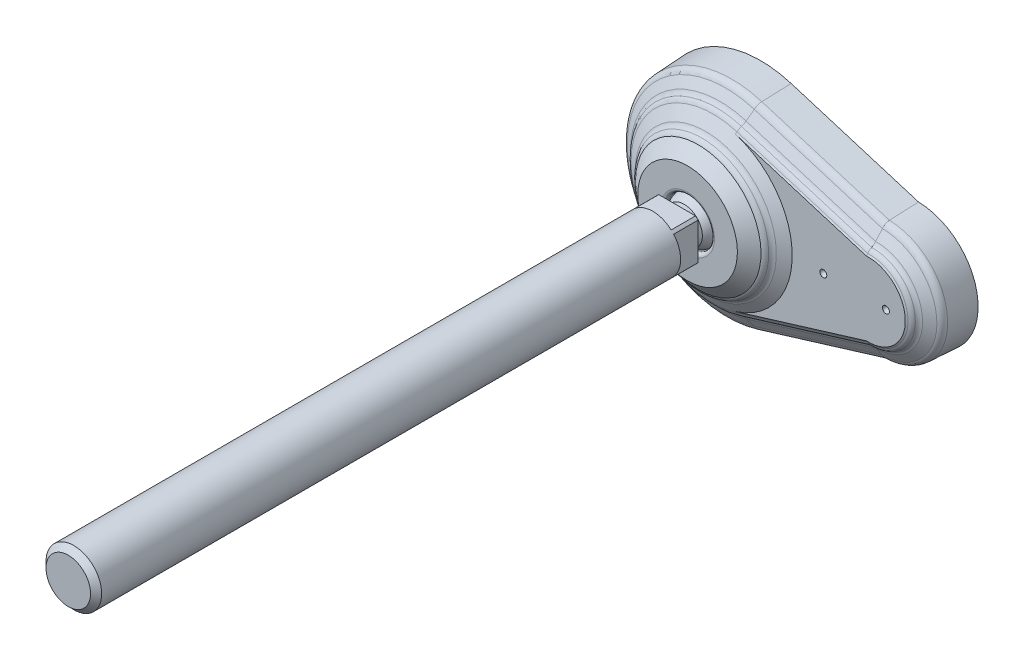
ISO-10303-21;
HEADER;
FILE_DESCRIPTION(('STEP AP214'),'2;1');
FILE_NAME('part.step','',(''),(''),'','','');
FILE_SCHEMA(('AUTOMOTIVE_DESIGN { 1 0 10303 214 1 1 1 1 }'));
ENDSEC;
DATA;
#1=APPLICATION_CONTEXT('core data for automotive mechanical design processes');
#2=APPLICATION_PROTOCOL_DEFINITION('international standard','automotive_design',2000,#1);
#3=PRODUCT_CONTEXT('',#1,'mechanical');
#4=PRODUCT('Part','Part','',(#3));
#5=PRODUCT_RELATED_PRODUCT_CATEGORY('part','',(#4));
#6=PRODUCT_DEFINITION_FORMATION('','',#4);
#7=PRODUCT_DEFINITION_CONTEXT('part definition',#1,'design');
#8=PRODUCT_DEFINITION('design','',#6,#7);
#9=PRODUCT_DEFINITION_SHAPE('','',#8);
#10=(LENGTH_UNIT() NAMED_UNIT(*) SI_UNIT(.MILLI.,.METRE.));
#11=(NAMED_UNIT(*) PLANE_ANGLE_UNIT() SI_UNIT($,.RADIAN.));
#12=(NAMED_UNIT(*) SI_UNIT($,.STERADIAN.) SOLID_ANGLE_UNIT());
#13=UNCERTAINTY_MEASURE_WITH_UNIT(LENGTH_MEASURE(1.E-05),#10,'distance_accuracy_value','');
#14=(GEOMETRIC_REPRESENTATION_CONTEXT(3) GLOBAL_UNCERTAINTY_ASSIGNED_CONTEXT((#13)) GLOBAL_UNIT_ASSIGNED_CONTEXT((#10,
#11,#12)) REPRESENTATION_CONTEXT('',''));
#15=CARTESIAN_POINT('',(0.,0.,0.));
#16=DIRECTION('',(0.,0.,1.));
#17=DIRECTION('',(1.,0.,0.));
#18=AXIS2_PLACEMENT_3D('',#15,#16,#17);
#19=CARTESIAN_POINT('',(0.,0.,31.));
#20=DIRECTION('',(0.,0.,1.));
#21=DIRECTION('',(-1.,0.,0.));
#22=AXIS2_PLACEMENT_3D('',#19,#20,#21);
#23=CYLINDRICAL_SURFACE('',#22,8.);
#24=CARTESIAN_POINT('',(0.,0.,197.4));
#25=DIRECTION('',(0.,0.,1.));
#26=DIRECTION('',(1.,0.,0.));
#27=AXIS2_PLACEMENT_3D('',#24,#25,#26);
#28=CIRCLE('',#27,8.);
#29=CARTESIAN_POINT('',(8.,0.,197.4));
#30=VERTEX_POINT('',#29);
#31=EDGE_CURVE('E9',#30,#30,#28,.F.);
#32=ORIENTED_EDGE('',*,*,#31,.T.);
#33=EDGE_LOOP('',(#32));
#34=FACE_BOUND('',#33,.T.);
#35=DIRECTION('',(0.,0.,1.));
#36=VECTOR('',#35,1.);
#37=CARTESIAN_POINT('',(6.,-5.29150262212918,31.));
#38=LINE('',#37,#36);
#39=CARTESIAN_POINT('',(6.,-5.29150262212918,31.));
#40=VERTEX_POINT('',#39);
#41=CARTESIAN_POINT('',(6.,-5.29150262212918,24.));
#42=VERTEX_POINT('',#41);
#43=EDGE_CURVE('E197',#40,#42,#38,.F.);
#44=ORIENTED_EDGE('',*,*,#43,.F.);
#45=CARTESIAN_POINT('',(0.,0.,31.));
#46=DIRECTION('',(0.,0.,1.));
#47=DIRECTION('',(1.,0.,0.));
#48=AXIS2_PLACEMENT_3D('',#45,#46,#47);
#49=CIRCLE('',#48,8.);
#50=CARTESIAN_POINT('',(6.,5.29150262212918,31.));
#51=VERTEX_POINT('',#50);
#52=EDGE_CURVE('E588',#40,#51,#49,.T.);
#53=ORIENTED_EDGE('',*,*,#52,.T.);
#54=DIRECTION('',(0.,0.,1.));
#55=VECTOR('',#54,1.);
#56=CARTESIAN_POINT('',(6.,5.29150262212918,31.));
#57=LINE('',#56,#55);
#58=CARTESIAN_POINT('',(6.,5.29150262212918,24.));
#59=VERTEX_POINT('',#58);
#60=EDGE_CURVE('E207',#59,#51,#57,.T.);
#61=ORIENTED_EDGE('',*,*,#60,.F.);
#62=CARTESIAN_POINT('',(0.,0.,24.));
#63=DIRECTION('',(0.,0.,1.));
#64=DIRECTION('',(-1.,0.,0.));
#65=AXIS2_PLACEMENT_3D('',#62,#63,#64);
#66=CIRCLE('',#65,8.);
#67=CARTESIAN_POINT('',(5.29150262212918,6.,24.));
#68=VERTEX_POINT('',#67);
#69=EDGE_CURVE('E180',#59,#68,#66,.T.);
#70=ORIENTED_EDGE('',*,*,#69,.T.);
#71=DIRECTION('',(0.,0.,1.));
#72=VECTOR('',#71,1.);
#73=CARTESIAN_POINT('',(5.29150262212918,6.,31.));
#74=LINE('',#73,#72);
#75=CARTESIAN_POINT('',(5.29150262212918,6.,31.));
#76=VERTEX_POINT('',#75);
#77=EDGE_CURVE('E161',#76,#68,#74,.F.);
#78=ORIENTED_EDGE('',*,*,#77,.F.);
#79=CARTESIAN_POINT('',(-5.29150262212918,6.,31.));
#80=VERTEX_POINT('',#79);
#81=EDGE_CURVE('E174',#76,#80,#49,.T.);
#82=ORIENTED_EDGE('',*,*,#81,.T.);
#83=DIRECTION('',(0.,0.,1.));
#84=VECTOR('',#83,1.);
#85=CARTESIAN_POINT('',(-5.29150262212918,6.,31.));
#86=LINE('',#85,#84);
#87=CARTESIAN_POINT('',(-5.29150262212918,6.,24.));
#88=VERTEX_POINT('',#87);
#89=EDGE_CURVE('E159',#88,#80,#86,.T.);
#90=ORIENTED_EDGE('',*,*,#89,.F.);
#91=CARTESIAN_POINT('',(-6.,5.29150262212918,24.));
#92=VERTEX_POINT('',#91);
#93=EDGE_CURVE('E172',#88,#92,#66,.T.);
#94=ORIENTED_EDGE('',*,*,#93,.T.);
#95=DIRECTION('',(0.,0.,1.));
#96=VECTOR('',#95,1.);
#97=CARTESIAN_POINT('',(-6.,5.29150262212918,31.));
#98=LINE('',#97,#96);
#99=CARTESIAN_POINT('',(-6.,5.29150262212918,31.));
#100=VERTEX_POINT('',#99);
#101=EDGE_CURVE('E175',#100,#92,#98,.F.);
#102=ORIENTED_EDGE('',*,*,#101,.F.);
#103=CARTESIAN_POINT('',(-6.,-5.29150262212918,31.));
#104=VERTEX_POINT('',#103);
#105=EDGE_CURVE('E598',#100,#104,#49,.T.);
#106=ORIENTED_EDGE('',*,*,#105,.T.);
#107=DIRECTION('',(0.,0.,1.));
#108=VECTOR('',#107,1.);
#109=CARTESIAN_POINT('',(-6.,-5.29150262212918,31.));
#110=LINE('',#109,#108);
#111=CARTESIAN_POINT('',(-6.,-5.29150262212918,24.));
#112=VERTEX_POINT('',#111);
#113=EDGE_CURVE('E181',#112,#104,#110,.T.);
#114=ORIENTED_EDGE('',*,*,#113,.F.);
#115=CARTESIAN_POINT('',(-5.29150262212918,-6.,24.));
#116=VERTEX_POINT('',#115);
#117=EDGE_CURVE('E183',#112,#116,#66,.T.);
#118=ORIENTED_EDGE('',*,*,#117,.T.);
#119=DIRECTION('',(0.,0.,1.));
#120=VECTOR('',#119,1.);
#121=CARTESIAN_POINT('',(-5.29150262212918,-6.,31.));
#122=LINE('',#121,#120);
#123=CARTESIAN_POINT('',(-5.29150262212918,-6.,31.));
#124=VERTEX_POINT('',#123);
#125=EDGE_CURVE('E136',#124,#116,#122,.F.);
#126=ORIENTED_EDGE('',*,*,#125,.F.);
#127=CARTESIAN_POINT('',(5.29150262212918,-6.,31.));
#128=VERTEX_POINT('',#127);
#129=EDGE_CURVE('E597',#124,#128,#49,.T.);
#130=ORIENTED_EDGE('',*,*,#129,.T.);
#131=DIRECTION('',(0.,0.,1.));
#132=VECTOR('',#131,1.);
#133=CARTESIAN_POINT('',(5.29150262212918,-6.,31.));
#134=LINE('',#133,#132);
#135=CARTESIAN_POINT('',(5.29150262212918,-6.,24.));
#136=VERTEX_POINT('',#135);
#137=EDGE_CURVE('E200',#136,#128,#134,.T.);
#138=ORIENTED_EDGE('',*,*,#137,.F.);
#139=EDGE_CURVE('E184',#136,#42,#66,.T.);
#140=ORIENTED_EDGE('',*,*,#139,.T.);
#141=EDGE_LOOP('',(#44,#53,#61,#70,#78,#82,#90,#94,#102,#106,#114,#118,#126,#130,#138,#140));
#142=FACE_BOUND('',#141,.T.);
#143=ADVANCED_FACE('F14',(#34,#142),#23,.T.);
#144=CARTESIAN_POINT('',(-5.24903501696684,0.,24.));
#145=DIRECTION('',(0.,0.,1.));
#146=DIRECTION('',(-1.,0.,0.));
#147=AXIS2_PLACEMENT_3D('',#144,#145,#146);
#148=PLANE('',#147);
#149=DIRECTION('',(0.,-1.,0.));
#150=VECTOR('',#149,1.);
#151=CARTESIAN_POINT('',(-6.,0.,24.));
#152=LINE('',#151,#150);
#153=EDGE_CURVE('E31',#92,#112,#152,.T.);
#154=ORIENTED_EDGE('',*,*,#153,.F.);
#155=ORIENTED_EDGE('',*,*,#93,.F.);
#156=DIRECTION('',(-1.,0.,0.));
#157=VECTOR('',#156,1.);
#158=CARTESIAN_POINT('',(-5.24903501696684,6.,24.));
#159=LINE('',#158,#157);
#160=EDGE_CURVE('E154',#68,#88,#159,.T.);
#161=ORIENTED_EDGE('',*,*,#160,.F.);
#162=ORIENTED_EDGE('',*,*,#69,.F.);
#163=DIRECTION('',(0.,1.,0.));
#164=VECTOR('',#163,1.);
#165=CARTESIAN_POINT('',(6.,0.,24.));
#166=LINE('',#165,#164);
#167=EDGE_CURVE('E203',#42,#59,#166,.T.);
#168=ORIENTED_EDGE('',*,*,#167,.F.);
#169=ORIENTED_EDGE('',*,*,#139,.F.);
#170=DIRECTION('',(1.,0.,0.));
#171=VECTOR('',#170,1.);
#172=CARTESIAN_POINT('',(-5.24903501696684,-6.,24.));
#173=LINE('',#172,#171);
#174=EDGE_CURVE('E202',#116,#136,#173,.T.);
#175=ORIENTED_EDGE('',*,*,#174,.F.);
#176=ORIENTED_EDGE('',*,*,#117,.F.);
#177=EDGE_LOOP('',(#154,#155,#161,#162,#168,#169,#175,#176));
#178=FACE_BOUND('',#177,.T.);
#179=CARTESIAN_POINT('',(0.,0.,24.));
#180=DIRECTION('',(0.,0.,1.));
#181=DIRECTION('',(-1.,0.,0.));
#182=AXIS2_PLACEMENT_3D('',#179,#180,#181);
#183=CIRCLE('',#182,5.24903501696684);
#184=CARTESIAN_POINT('',(-5.24903501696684,0.,24.));
#185=VERTEX_POINT('',#184);
#186=EDGE_CURVE('E189',#185,#185,#183,.T.);
#187=ORIENTED_EDGE('',*,*,#186,.T.);
#188=EDGE_LOOP('',(#187));
#189=FACE_BOUND('',#188,.T.);
#190=ADVANCED_FACE('F177',(#178,#189),#148,.F.);
#191=CARTESIAN_POINT('',(0.,0.,17.6309999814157));
#192=DIRECTION('',(0.,0.,1.));
#193=DIRECTION('',(-1.,0.,0.));
#194=AXIS2_PLACEMENT_3D('',#191,#192,#193);
#195=DEGENERATE_TOROIDAL_SURFACE('',#194,0.0005038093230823,6.829,.T.);
#196=CARTESIAN_POINT('',(0.,0.,18.775));
#197=DIRECTION('',(0.,0.,-1.));
#198=DIRECTION('',(1.,0.,0.));
#199=AXIS2_PLACEMENT_3D('',#196,#197,#198);
#200=CIRCLE('',#199,6.733);
#201=CARTESIAN_POINT('',(6.733,0.,18.775));
#202=VERTEX_POINT('',#201);
#203=EDGE_CURVE('E224',#202,#202,#200,.T.);
#204=ORIENTED_EDGE('',*,*,#203,.F.);
#205=EDGE_LOOP('',(#204));
#206=FACE_BOUND('',#205,.T.);
#207=CARTESIAN_POINT('',(0.,0.,22.));
#208=DIRECTION('',(0.,0.,1.));
#209=DIRECTION('',(-1.,0.,0.));
#210=AXIS2_PLACEMENT_3D('',#207,#208,#209);
#211=CIRCLE('',#210,5.24903501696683);
#212=CARTESIAN_POINT('',(-5.24903501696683,0.,22.));
#213=VERTEX_POINT('',#212);
#214=EDGE_CURVE('E191',#213,#213,#211,.T.);
#215=ORIENTED_EDGE('',*,*,#214,.F.);
#216=EDGE_LOOP('',(#215));
#217=FACE_BOUND('',#216,.T.);
#218=ADVANCED_FACE('F447',(#206,#217),#195,.T.);
#219=CARTESIAN_POINT('',(0.,0.,31.));
#220=DIRECTION('',(0.,0.,1.));
#221=DIRECTION('',(-1.,0.,0.));
#222=AXIS2_PLACEMENT_3D('',#219,#220,#221);
#223=CYLINDRICAL_SURFACE('',#222,5.24903501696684);
#224=ORIENTED_EDGE('',*,*,#186,.F.);
#225=EDGE_LOOP('',(#224));
#226=FACE_BOUND('',#225,.T.);
#227=ORIENTED_EDGE('',*,*,#214,.T.);
#228=EDGE_LOOP('',(#227));
#229=FACE_BOUND('',#228,.T.);
#230=ADVANCED_FACE('F549',(#226,#229),#223,.T.);
#231=CARTESIAN_POINT('',(-6.,-6.,23.));
#232=DIRECTION('',(0.,-1.,0.));
#233=DIRECTION('',(1.,0.,0.));
#234=AXIS2_PLACEMENT_3D('',#231,#232,#233);
#235=PLANE('',#234);
#236=ORIENTED_EDGE('',*,*,#137,.T.);
#237=DIRECTION('',(-1.,0.,0.));
#238=VECTOR('',#237,1.);
#239=CARTESIAN_POINT('',(-8.,-6.,31.));
#240=LINE('',#239,#238);
#241=EDGE_CURVE('E556',#128,#124,#240,.T.);
#242=ORIENTED_EDGE('',*,*,#241,.T.);
#243=ORIENTED_EDGE('',*,*,#125,.T.);
#244=ORIENTED_EDGE('',*,*,#174,.T.);
#245=EDGE_LOOP('',(#236,#242,#243,#244));
#246=FACE_BOUND('',#245,.T.);
#247=ADVANCED_FACE('F547',(#246),#235,.T.);
#248=CARTESIAN_POINT('',(6.,-6.,23.));
#249=DIRECTION('',(1.,0.,0.));
#250=DIRECTION('',(0.,1.,0.));
#251=AXIS2_PLACEMENT_3D('',#248,#249,#250);
#252=PLANE('',#251);
#253=ORIENTED_EDGE('',*,*,#60,.T.);
#254=DIRECTION('',(0.,-1.,0.));
#255=VECTOR('',#254,1.);
#256=CARTESIAN_POINT('',(6.,0.,31.));
#257=LINE('',#256,#255);
#258=EDGE_CURVE('E566',#51,#40,#257,.T.);
#259=ORIENTED_EDGE('',*,*,#258,.T.);
#260=ORIENTED_EDGE('',*,*,#43,.T.);
#261=ORIENTED_EDGE('',*,*,#167,.T.);
#262=EDGE_LOOP('',(#253,#259,#260,#261));
#263=FACE_BOUND('',#262,.T.);
#264=ADVANCED_FACE('F543',(#263),#252,.T.);
#265=CARTESIAN_POINT('',(6.,6.,23.));
#266=DIRECTION('',(0.,1.,0.));
#267=DIRECTION('',(-1.,0.,0.));
#268=AXIS2_PLACEMENT_3D('',#265,#266,#267);
#269=PLANE('',#268);
#270=ORIENTED_EDGE('',*,*,#89,.T.);
#271=DIRECTION('',(1.,0.,0.));
#272=VECTOR('',#271,1.);
#273=CARTESIAN_POINT('',(-8.,6.,31.));
#274=LINE('',#273,#272);
#275=EDGE_CURVE('E231',#80,#76,#274,.T.);
#276=ORIENTED_EDGE('',*,*,#275,.T.);
#277=ORIENTED_EDGE('',*,*,#77,.T.);
#278=ORIENTED_EDGE('',*,*,#160,.T.);
#279=EDGE_LOOP('',(#270,#276,#277,#278));
#280=FACE_BOUND('',#279,.T.);
#281=ADVANCED_FACE('F156',(#280),#269,.T.);
#282=CARTESIAN_POINT('',(-6.,6.,23.));
#283=DIRECTION('',(-1.,0.,0.));
#284=DIRECTION('',(0.,-1.,0.));
#285=AXIS2_PLACEMENT_3D('',#282,#283,#284);
#286=PLANE('',#285);
#287=ORIENTED_EDGE('',*,*,#113,.T.);
#288=DIRECTION('',(0.,1.,0.));
#289=VECTOR('',#288,1.);
#290=CARTESIAN_POINT('',(-6.,0.,31.));
#291=LINE('',#290,#289);
#292=EDGE_CURVE('E217',#104,#100,#291,.T.);
#293=ORIENTED_EDGE('',*,*,#292,.T.);
#294=ORIENTED_EDGE('',*,*,#101,.T.);
#295=ORIENTED_EDGE('',*,*,#153,.T.);
#296=EDGE_LOOP('',(#287,#293,#294,#295));
#297=FACE_BOUND('',#296,.T.);
#298=ADVANCED_FACE('F457',(#297),#286,.T.);
#299=CARTESIAN_POINT('',(45.,0.,0.));
#300=DIRECTION('',(0.,0.,-1.));
#301=DIRECTION('',(0.,1.,0.));
#302=AXIS2_PLACEMENT_3D('',#299,#300,#301);
#303=CONICAL_SURFACE('',#302,17.5,0.0523365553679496);
#304=CARTESIAN_POINT('',(45.,0.,8.304));
#305=DIRECTION('',(0.,0.,1.));
#306=DIRECTION('',(0.,-1.,0.));
#307=AXIS2_PLACEMENT_3D('',#304,#305,#306);
#308=CIRCLE('',#307,17.065);
#309=CARTESIAN_POINT('',(45.3136024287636,-17.0621182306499,8.304));
#310=VERTEX_POINT('',#309);
#311=CARTESIAN_POINT('',(45.3136024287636,17.0621182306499,8.304));
#312=VERTEX_POINT('',#311);
#313=EDGE_CURVE('E276',#310,#312,#308,.T.);
#314=ORIENTED_EDGE('',*,*,#313,.F.);
#315=CARTESIAN_POINT('',(45.3136007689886,-17.0621077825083,8.3042));
#316=CARTESIAN_POINT('',(45.3250873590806,-17.134412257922,6.92013380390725));
#317=CARTESIAN_POINT('',(45.3366049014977,-17.206707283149,5.5360673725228));
#318=CARTESIAN_POINT('',(45.3597018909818,-17.3512784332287,2.76793403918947));
#319=CARTESIAN_POINT('',(45.3712813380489,-17.4235545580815,1.38386713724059));
#320=CARTESIAN_POINT('',(45.3828917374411,-17.4958212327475,-0.00020000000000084));
#321=B_SPLINE_CURVE_WITH_KNOTS('',3,(#315,#316,#317,#318,#319,#320),.UNSPECIFIED.,.F.,.F.,(4,2,
4),(0.,4.15800336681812,8.31600673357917),.UNSPECIFIED.);
#322=CARTESIAN_POINT('',(45.3828900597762,-17.4958107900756,0.));
#323=VERTEX_POINT('',#322);
#324=EDGE_CURVE('E955',#310,#323,#321,.T.);
#325=ORIENTED_EDGE('',*,*,#324,.T.);
#326=CARTESIAN_POINT('',(45.,0.,0.));
#327=DIRECTION('',(0.,0.,1.));
#328=DIRECTION('',(0.,-1.,0.));
#329=AXIS2_PLACEMENT_3D('',#326,#327,#328);
#330=CIRCLE('',#329,17.5);
#331=CARTESIAN_POINT('',(45.3828900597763,17.4958107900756,0.));
#332=VERTEX_POINT('',#331);
#333=EDGE_CURVE('E279',#323,#332,#330,.T.);
#334=ORIENTED_EDGE('',*,*,#333,.T.);
#335=CARTESIAN_POINT('',(45.3828917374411,17.4958212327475,-0.0002));
#336=CARTESIAN_POINT('',(45.371281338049,17.4235545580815,1.38386713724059));
#337=CARTESIAN_POINT('',(45.359701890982,17.3512784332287,2.76793403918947));
#338=CARTESIAN_POINT('',(45.3366049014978,17.206707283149,5.5360673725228));
#339=CARTESIAN_POINT('',(45.3250873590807,17.134412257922,6.92013380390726));
#340=CARTESIAN_POINT('',(45.3136007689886,17.0621077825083,8.3042));
#341=B_SPLINE_CURVE_WITH_KNOTS('',3,(#335,#336,#337,#338,#339,#340),.UNSPECIFIED.,.F.,.F.,(4,2,
4),(0.,4.15800336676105,8.31600673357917),.UNSPECIFIED.);
#342=EDGE_CURVE('E953',#332,#312,#341,.T.);
#343=ORIENTED_EDGE('',*,*,#342,.T.);
#344=EDGE_LOOP('',(#314,#325,#334,#343));
#345=FACE_BOUND('',#344,.T.);
#346=ADVANCED_FACE('F337',(#345),#303,.T.);
#347=CARTESIAN_POINT('',(46.8961596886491,-16.5782819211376,8.304));
#348=DIRECTION('',(-0.291971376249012,0.9549953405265,-0.0523126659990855));
#349=DIRECTION('',(-0.956304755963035,-0.292371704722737,0.));
#350=AXIS2_PLACEMENT_3D('',#347,#348,#349);
#351=PLANE('',#350);
#352=ORIENTED_EDGE('',*,*,#324,.F.);
#353=DIRECTION('',(-0.956304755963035,-0.292371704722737,0.));
#354=VECTOR('',#353,1.);
#355=CARTESIAN_POINT('',(46.8961596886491,-16.5782819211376,8.304));
#356=LINE('',#355,#354);
#357=CARTESIAN_POINT('',(8.64396945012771,-28.2731501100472,8.304));
#358=VERTEX_POINT('',#357);
#359=EDGE_CURVE('E990',#310,#358,#356,.T.);
#360=ORIENTED_EDGE('',*,*,#359,.T.);
#361=DIRECTION('',(-0.0152947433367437,0.050026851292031,0.998630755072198));
#362=VECTOR('',#361,1.);
#363=CARTESIAN_POINT('',(8.7711511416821,-28.689142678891,0.));
#364=LINE('',#363,#362);
#365=CARTESIAN_POINT('',(8.7711511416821,-28.689142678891,0.));
#366=VERTEX_POINT('',#365);
#367=EDGE_CURVE('E1003',#366,#358,#364,.T.);
#368=ORIENTED_EDGE('',*,*,#367,.F.);
#369=DIRECTION('',(-0.956304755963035,-0.292371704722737,0.));
#370=VECTOR('',#369,1.);
#371=CARTESIAN_POINT('',(47.0233413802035,-16.9942744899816,0.));
#372=LINE('',#371,#370);
#373=EDGE_CURVE('E127',#323,#366,#372,.T.);
#374=ORIENTED_EDGE('',*,*,#373,.F.);
#375=EDGE_LOOP('',(#352,#360,#368,#374));
#376=FACE_BOUND('',#375,.T.);
#377=ADVANCED_FACE('F443',(#376),#351,.F.);
#378=CARTESIAN_POINT('',(0.,0.,0.));
#379=DIRECTION('',(0.,0.,1.));
#380=DIRECTION('',(0.,-1.,0.));
#381=AXIS2_PLACEMENT_3D('',#378,#379,#380);
#382=PLANE('',#381);
#383=DIRECTION('',(-0.956304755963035,0.292371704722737,0.));
#384=VECTOR('',#383,1.);
#385=CARTESIAN_POINT('',(47.0233413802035,16.9942744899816,0.));
#386=LINE('',#385,#384);
#387=CARTESIAN_POINT('',(8.7711511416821,28.689142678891,0.));
#388=VERTEX_POINT('',#387);
#389=EDGE_CURVE('E988',#332,#388,#386,.T.);
#390=ORIENTED_EDGE('',*,*,#389,.F.);
#391=ORIENTED_EDGE('',*,*,#333,.F.);
#392=ORIENTED_EDGE('',*,*,#373,.T.);
#393=CARTESIAN_POINT('',(0.,0.,0.));
#394=DIRECTION('',(0.,0.,1.));
#395=DIRECTION('',(0.,-1.,0.));
#396=AXIS2_PLACEMENT_3D('',#393,#394,#395);
#397=CIRCLE('',#396,30.);
#398=EDGE_CURVE('E325',#388,#366,#397,.T.);
#399=ORIENTED_EDGE('',*,*,#398,.F.);
#400=EDGE_LOOP('',(#390,#391,#392,#399));
#401=FACE_BOUND('',#400,.T.);
#402=CARTESIAN_POINT('',(32.,0.,0.));
#403=DIRECTION('',(0.,0.,-1.));
#404=DIRECTION('',(-1.,0.,0.));
#405=AXIS2_PLACEMENT_3D('',#402,#403,#404);
#406=CIRCLE('',#405,4.25);
#407=CARTESIAN_POINT('',(27.75,0.,0.));
#408=VERTEX_POINT('',#407);
#409=EDGE_CURVE('E602',#408,#408,#406,.T.);
#410=ORIENTED_EDGE('',*,*,#409,.F.);
#411=EDGE_LOOP('',(#410));
#412=FACE_BOUND('',#411,.T.);
#413=CARTESIAN_POINT('',(50.,0.,0.));
#414=DIRECTION('',(0.,0.,-1.));
#415=DIRECTION('',(-1.,0.,0.));
#416=AXIS2_PLACEMENT_3D('',#413,#414,#415);
#417=CIRCLE('',#416,4.25);
#418=CARTESIAN_POINT('',(45.75,0.,0.));
#419=VERTEX_POINT('',#418);
#420=EDGE_CURVE('E612',#419,#419,#417,.T.);
#421=ORIENTED_EDGE('',*,*,#420,.F.);
#422=EDGE_LOOP('',(#421));
#423=FACE_BOUND('',#422,.T.);
#424=ADVANCED_FACE('F335',(#401,#412,#423),#382,.F.);
#425=CARTESIAN_POINT('',(47.0233413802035,16.9942744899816,0.));
#426=DIRECTION('',(-0.291971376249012,-0.9549953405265,-0.0523126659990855));
#427=DIRECTION('',(0.956304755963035,-0.292371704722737,0.));
#428=AXIS2_PLACEMENT_3D('',#425,#426,#427);
#429=PLANE('',#428);
#430=ORIENTED_EDGE('',*,*,#342,.F.);
#431=ORIENTED_EDGE('',*,*,#389,.T.);
#432=DIRECTION('',(-0.0152947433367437,-0.050026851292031,0.998630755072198));
#433=VECTOR('',#432,1.);
#434=CARTESIAN_POINT('',(8.7711511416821,28.689142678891,0.));
#435=LINE('',#434,#433);
#436=CARTESIAN_POINT('',(8.64396945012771,28.2731501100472,8.304));
#437=VERTEX_POINT('',#436);
#438=EDGE_CURVE('E1020',#388,#437,#435,.T.);
#439=ORIENTED_EDGE('',*,*,#438,.T.);
#440=DIRECTION('',(-0.956304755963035,0.292371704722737,0.));
#441=VECTOR('',#440,1.);
#442=CARTESIAN_POINT('',(46.8961596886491,16.5782819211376,8.304));
#443=LINE('',#442,#441);
#444=EDGE_CURVE('E986',#312,#437,#443,.T.);
#445=ORIENTED_EDGE('',*,*,#444,.F.);
#446=EDGE_LOOP('',(#430,#431,#439,#445));
#447=FACE_BOUND('',#446,.T.);
#448=ADVANCED_FACE('F413',(#447),#429,.F.);
#449=CARTESIAN_POINT('',(45.,0.,8.20868962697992));
#450=DIRECTION('',(0.,0.,1.));
#451=DIRECTION('',(0.,-1.,0.));
#452=AXIS2_PLACEMENT_3D('',#449,#450,#451);
#453=TOROIDAL_SURFACE('',#452,15.0672723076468,2.);
#454=CARTESIAN_POINT('',(45.313603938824,-17.062127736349,8.3038));
#455=CARTESIAN_POINT('',(45.3131828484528,-17.0594763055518,8.3596419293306));
#456=CARTESIAN_POINT('',(45.3123906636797,-17.0544900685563,8.41534315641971));
#457=CARTESIAN_POINT('',(45.3100724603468,-17.0398916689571,8.52611669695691));
#458=CARTESIAN_POINT('',(45.3085464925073,-17.0302798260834,8.5811890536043));
#459=CARTESIAN_POINT('',(45.3028875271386,-16.9946160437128,8.7447437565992));
#460=CARTESIAN_POINT('',(45.2976717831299,-16.9617253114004,8.85178061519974));
#461=CARTESIAN_POINT('',(45.284530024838,-16.8786837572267,9.05872519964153));
#462=CARTESIAN_POINT('',(45.2766032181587,-16.8285278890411,9.1586308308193));
#463=CARTESIAN_POINT('',(45.2583029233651,-16.7124179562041,9.34857034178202));
#464=CARTESIAN_POINT('',(45.24792931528,-16.6464631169,9.43860373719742));
#465=CARTESIAN_POINT('',(45.2250216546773,-16.5003240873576,9.60671335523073));
#466=CARTESIAN_POINT('',(45.2124772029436,-16.4200713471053,9.68472843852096));
#467=CARTESIAN_POINT('',(45.1856662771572,-16.2478592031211,9.8261370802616));
#468=CARTESIAN_POINT('',(45.1714009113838,-16.1559073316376,9.88953997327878));
#469=CARTESIAN_POINT('',(45.148748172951,-16.0092275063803,9.97356807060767));
#470=CARTESIAN_POINT('',(45.1408156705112,-15.957749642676,10.0001426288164));
#471=CARTESIAN_POINT('',(45.1246863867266,-15.8528232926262,10.0486569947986));
#472=CARTESIAN_POINT('',(45.1164901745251,-15.7993790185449,10.0706061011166));
#473=CARTESIAN_POINT('',(45.1081834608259,-15.7450737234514,10.0902));
#474=B_SPLINE_CURVE_WITH_KNOTS('',3,(#454,#455,#456,#457,#458,#459,#460,#461,#462,#463,#464,
#465,#466,#467,#468,#469,#470,#471,#472,#473),.UNSPECIFIED.,.F.,.F.,(4,2,2,2,2,2,2,2,2,4),(0.,
0.167615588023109,0.335219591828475,0.669784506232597,1.00444729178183,1.33912648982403,
1.67545571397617,2.01156948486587,2.1867983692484,2.36167155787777),.UNSPECIFIED.);
#475=CARTESIAN_POINT('',(45.108268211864,-15.7456277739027,10.09));
#476=VERTEX_POINT('',#475);
#477=EDGE_CURVE('E948',#310,#476,#474,.T.);
#478=ORIENTED_EDGE('',*,*,#477,.F.);
#479=ORIENTED_EDGE('',*,*,#313,.T.);
#480=CARTESIAN_POINT('',(45.1081834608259,15.7450737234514,10.0902));
#481=CARTESIAN_POINT('',(45.1162755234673,15.7979756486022,10.0711117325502));
#482=CARTESIAN_POINT('',(45.1242625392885,15.8500594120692,10.0497900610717));
#483=CARTESIAN_POINT('',(45.1399729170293,15.9522733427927,10.0028085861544));
#484=CARTESIAN_POINT('',(45.1476962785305,16.0024035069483,9.97714877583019));
#485=CARTESIAN_POINT('',(45.170371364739,16.1492634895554,9.89392549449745));
#486=CARTESIAN_POINT('',(45.1848488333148,16.2425982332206,9.83006921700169));
#487=CARTESIAN_POINT('',(45.2120467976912,16.4173167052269,9.6873614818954));
#488=CARTESIAN_POINT('',(45.2247661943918,16.4986929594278,9.60850071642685));
#489=CARTESIAN_POINT('',(45.2480269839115,16.647087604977,9.4379734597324));
#490=CARTESIAN_POINT('',(45.2585686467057,16.7141077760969,9.34630855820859));
#491=CARTESIAN_POINT('',(45.2770522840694,16.8313730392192,9.15345563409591));
#492=CARTESIAN_POINT('',(45.2850114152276,16.8817288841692,9.05233645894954));
#493=CARTESIAN_POINT('',(45.298151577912,16.9647535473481,8.84294631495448));
#494=CARTESIAN_POINT('',(45.3033350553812,16.9974379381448,8.73468173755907));
#495=CARTESIAN_POINT('',(45.3088197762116,17.0320013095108,8.57167924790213));
#496=CARTESIAN_POINT('',(45.3102579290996,17.0410597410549,8.51840996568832));
#497=CARTESIAN_POINT('',(45.3124461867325,17.0548396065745,8.41140374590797));
#498=CARTESIAN_POINT('',(45.3131976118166,17.0595693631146,8.35766790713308));
#499=CARTESIAN_POINT('',(45.313603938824,17.062127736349,8.3038));
#500=B_SPLINE_CURVE_WITH_KNOTS('',3,(#480,#481,#482,#483,#484,#485,#486,#487,#488,#489,#490,
#491,#492,#493,#494,#495,#496,#497,#498,#499),.UNSPECIFIED.,.F.,.F.,(4,2,2,2,2,2,2,2,2,4),(0.,
0.170355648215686,0.340711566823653,0.680992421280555,1.02148505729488,1.36193545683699,
1.70007548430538,2.03791704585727,2.19992239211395,2.36161559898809),.UNSPECIFIED.);
#501=CARTESIAN_POINT('',(45.1082682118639,15.7456277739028,10.09));
#502=VERTEX_POINT('',#501);
#503=EDGE_CURVE('E402',#502,#312,#500,.T.);
#504=ORIENTED_EDGE('',*,*,#503,.F.);
#505=CARTESIAN_POINT('',(45.,0.,10.09));
#506=DIRECTION('',(0.,0.,1.));
#507=DIRECTION('',(0.,-1.,0.));
#508=AXIS2_PLACEMENT_3D('',#505,#506,#507);
#509=CIRCLE('',#508,15.746);
#510=EDGE_CURVE('E273',#476,#502,#509,.T.);
#511=ORIENTED_EDGE('',*,*,#510,.F.);
#512=EDGE_LOOP('',(#478,#479,#504,#511));
#513=FACE_BOUND('',#512,.T.);
#514=ADVANCED_FACE('F386',(#513),#453,.T.);
#515=CARTESIAN_POINT('',(46.312080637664,-14.6678454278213,8.20868962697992));
#516=DIRECTION('',(-0.956304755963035,-0.292371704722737,0.));
#517=DIRECTION('',(0.292371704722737,-0.956304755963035,0.));
#518=AXIS2_PLACEMENT_3D('',#515,#516,#517);
#519=CYLINDRICAL_SURFACE('',#518,2.);
#520=ORIENTED_EDGE('',*,*,#359,.F.);
#521=ORIENTED_EDGE('',*,*,#477,.T.);
#522=DIRECTION('',(-0.956304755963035,-0.292371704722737,0.));
#523=VECTOR('',#522,1.);
#524=CARTESIAN_POINT('',(46.5105214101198,-15.3169159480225,10.09));
#525=LINE('',#524,#523);
#526=CARTESIAN_POINT('',(8.25833117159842,-27.0117841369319,10.09));
#527=VERTEX_POINT('',#526);
#528=EDGE_CURVE('E992',#476,#527,#525,.T.);
#529=ORIENTED_EDGE('',*,*,#528,.T.);
#530=CARTESIAN_POINT('',(8.05989039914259,-26.3627136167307,8.20868962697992));
#531=DIRECTION('',(0.956304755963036,0.292371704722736,0.));
#532=DIRECTION('',(-0.292371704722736,0.956304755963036,0.));
#533=AXIS2_PLACEMENT_3D('',#530,#531,#532);
#534=CIRCLE('',#533,2.);
#535=EDGE_CURVE('E1006',#527,#358,#534,.T.);
#536=ORIENTED_EDGE('',*,*,#535,.T.);
#537=EDGE_LOOP('',(#520,#521,#529,#536));
#538=FACE_BOUND('',#537,.T.);
#539=ADVANCED_FACE('F414',(#538),#519,.T.);
#540=CARTESIAN_POINT('',(0.,0.,0.));
#541=DIRECTION('',(0.,0.,-1.));
#542=DIRECTION('',(0.,1.,0.));
#543=AXIS2_PLACEMENT_3D('',#540,#541,#542);
#544=CONICAL_SURFACE('',#543,30.,0.0523365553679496);
#545=CARTESIAN_POINT('',(0.,0.,8.304));
#546=DIRECTION('',(0.,0.,1.));
#547=DIRECTION('',(0.,-1.,0.));
#548=AXIS2_PLACEMENT_3D('',#545,#546,#547);
#549=CIRCLE('',#548,29.565);
#550=EDGE_CURVE('E1049',#437,#358,#549,.T.);
#551=ORIENTED_EDGE('',*,*,#550,.F.);
#552=ORIENTED_EDGE('',*,*,#438,.F.);
#553=ORIENTED_EDGE('',*,*,#398,.T.);
#554=ORIENTED_EDGE('',*,*,#367,.T.);
#555=EDGE_LOOP('',(#551,#552,#553,#554));
#556=FACE_BOUND('',#555,.T.);
#557=ADVANCED_FACE('F434',(#556),#544,.T.);
#558=CARTESIAN_POINT('',(46.312080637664,14.6678454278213,8.20868962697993));
#559=DIRECTION('',(-0.956304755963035,0.292371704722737,0.));
#560=DIRECTION('',(-0.292371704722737,-0.956304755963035,0.));
#561=AXIS2_PLACEMENT_3D('',#558,#559,#560);
#562=CYLINDRICAL_SURFACE('',#561,2.);
#563=DIRECTION('',(-0.956304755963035,0.292371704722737,0.));
#564=VECTOR('',#563,1.);
#565=CARTESIAN_POINT('',(46.5105214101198,15.3169159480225,10.09));
#566=LINE('',#565,#564);
#567=CARTESIAN_POINT('',(8.25833117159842,27.0117841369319,10.09));
#568=VERTEX_POINT('',#567);
#569=EDGE_CURVE('E984',#502,#568,#566,.T.);
#570=ORIENTED_EDGE('',*,*,#569,.F.);
#571=ORIENTED_EDGE('',*,*,#503,.T.);
#572=ORIENTED_EDGE('',*,*,#444,.T.);
#573=CARTESIAN_POINT('',(8.05989039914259,26.3627136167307,8.20868962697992));
#574=DIRECTION('',(-0.956304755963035,0.292371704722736,0.));
#575=DIRECTION('',(-0.292371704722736,-0.956304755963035,0.));
#576=AXIS2_PLACEMENT_3D('',#573,#574,#575);
#577=CIRCLE('',#576,2.);
#578=EDGE_CURVE('E1023',#568,#437,#577,.T.);
#579=ORIENTED_EDGE('',*,*,#578,.F.);
#580=EDGE_LOOP('',(#570,#571,#572,#579));
#581=FACE_BOUND('',#580,.T.);
#582=ADVANCED_FACE('F345',(#581),#562,.T.);
#583=CARTESIAN_POINT('',(45.,0.,10.09));
#584=DIRECTION('',(0.,0.,-1.));
#585=DIRECTION('',(0.,1.,0.));
#586=AXIS2_PLACEMENT_3D('',#583,#584,#585);
#587=CONICAL_SURFACE('',#586,15.746,0.993858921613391);
#588=CARTESIAN_POINT('',(45.,0.,11.7170000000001));
#589=DIRECTION('',(0.,0.,1.));
#590=DIRECTION('',(0.,-1.,0.));
#591=AXIS2_PLACEMENT_3D('',#588,#589,#590);
#592=CIRCLE('',#591,13.2459999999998);
#593=CARTESIAN_POINT('',(44.7416637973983,-13.243480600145,11.7170000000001));
#594=VERTEX_POINT('',#593);
#595=CARTESIAN_POINT('',(44.7416637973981,13.2434806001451,11.7170000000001));
#596=VERTEX_POINT('',#595);
#597=EDGE_CURVE('E271',#594,#596,#592,.T.);
#598=ORIENTED_EDGE('',*,*,#597,.F.);
#599=CARTESIAN_POINT('',(44.7416208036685,-13.2431723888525,11.7172000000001));
#600=CARTESIAN_POINT('',(44.8000092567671,-13.66082442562,11.4461588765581));
#601=CARTESIAN_POINT('',(44.8597613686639,-14.078214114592,11.1750215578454));
#602=CARTESIAN_POINT('',(44.9819928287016,-14.9124682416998,10.6325548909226));
#603=CARTESIAN_POINT('',(45.0444721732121,-15.3293326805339,10.3612255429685));
#604=CARTESIAN_POINT('',(45.1083151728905,-15.745934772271,10.0898));
#605=B_SPLINE_CURVE_WITH_KNOTS('',3,(#599,#600,#601,#602,#603,#604),.UNSPECIFIED.,.F.,.F.,(4,2,
4),(0.,1.50389468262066,3.0077873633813),.UNSPECIFIED.);
#606=EDGE_CURVE('E395',#594,#476,#605,.T.);
#607=ORIENTED_EDGE('',*,*,#606,.T.);
#608=ORIENTED_EDGE('',*,*,#510,.T.);
#609=CARTESIAN_POINT('',(45.1083151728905,15.745934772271,10.0898));
#610=CARTESIAN_POINT('',(45.0444721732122,15.3293326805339,10.3612255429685));
#611=CARTESIAN_POINT('',(44.9819928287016,14.9124682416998,10.6325548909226));
#612=CARTESIAN_POINT('',(44.8597613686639,14.078214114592,11.1750215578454));
#613=CARTESIAN_POINT('',(44.8000092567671,13.66082442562,11.4461588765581));
#614=CARTESIAN_POINT('',(44.7416208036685,13.2431723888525,11.7172000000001));
#615=B_SPLINE_CURVE_WITH_KNOTS('',3,(#609,#610,#611,#612,#613,#614),.UNSPECIFIED.,.F.,.F.,(4,2,
4),(0.,1.50389268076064,3.0077873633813),.UNSPECIFIED.);
#616=EDGE_CURVE('E389',#502,#596,#615,.T.);
#617=ORIENTED_EDGE('',*,*,#616,.T.);
#618=EDGE_LOOP('',(#598,#607,#608,#617));
#619=FACE_BOUND('',#618,.T.);
#620=ADVANCED_FACE('F380',(#619),#587,.T.);
#621=CARTESIAN_POINT('',(45.7795921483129,-12.9261540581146,11.7170000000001));
#622=DIRECTION('',(-0.159476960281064,0.521625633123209,-0.838137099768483));
#623=DIRECTION('',(0.,0.849002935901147,0.528388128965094));
#624=AXIS2_PLACEMENT_3D('',#621,#622,#623);
#625=PLANE('',#624);
#626=ORIENTED_EDGE('',*,*,#606,.F.);
#627=DIRECTION('',(-0.956304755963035,-0.292371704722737,0.));
#628=VECTOR('',#627,1.);
#629=CARTESIAN_POINT('',(45.7795921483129,-12.9261540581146,11.7170000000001));
#630=LINE('',#629,#628);
#631=CARTESIAN_POINT('',(7.52740190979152,-24.6210222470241,11.7170000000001));
#632=VERTEX_POINT('',#631);
#633=EDGE_CURVE('E994',#594,#632,#630,.T.);
#634=ORIENTED_EDGE('',*,*,#633,.T.);
#635=DIRECTION('',(-0.245047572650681,0.801514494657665,0.545459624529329));
#636=VECTOR('',#635,1.);
#637=CARTESIAN_POINT('',(8.25833117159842,-27.0117841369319,10.09));
#638=LINE('',#637,#636);
#639=EDGE_CURVE('E1009',#527,#632,#638,.T.);
#640=ORIENTED_EDGE('',*,*,#639,.F.);
#641=ORIENTED_EDGE('',*,*,#528,.F.);
#642=EDGE_LOOP('',(#626,#634,#640,#641));
#643=FACE_BOUND('',#642,.T.);
#644=ADVANCED_FACE('F384',(#643),#625,.F.);
#645=CARTESIAN_POINT('',(0.,0.,8.20868962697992));
#646=DIRECTION('',(0.,0.,1.));
#647=DIRECTION('',(0.,-1.,0.));
#648=AXIS2_PLACEMENT_3D('',#645,#646,#647);
#649=TOROIDAL_SURFACE('',#648,27.5672723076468,2.);
#650=CARTESIAN_POINT('',(0.,0.,10.09));
#651=DIRECTION('',(0.,0.,1.));
#652=DIRECTION('',(0.,-1.,0.));
#653=AXIS2_PLACEMENT_3D('',#650,#651,#652);
#654=CIRCLE('',#653,28.246);
#655=EDGE_CURVE('E1047',#568,#527,#654,.T.);
#656=ORIENTED_EDGE('',*,*,#655,.F.);
#657=ORIENTED_EDGE('',*,*,#578,.T.);
#658=ORIENTED_EDGE('',*,*,#550,.T.);
#659=ORIENTED_EDGE('',*,*,#535,.F.);
#660=EDGE_LOOP('',(#656,#657,#658,#659));
#661=FACE_BOUND('',#660,.T.);
#662=ADVANCED_FACE('F411',(#661),#649,.T.);
#663=CARTESIAN_POINT('',(46.5105214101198,15.3169159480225,10.09));
#664=DIRECTION('',(-0.159476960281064,-0.521625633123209,-0.838137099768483));
#665=DIRECTION('',(0.,0.849002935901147,-0.528388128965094));
#666=AXIS2_PLACEMENT_3D('',#663,#664,#665);
#667=PLANE('',#666);
#668=ORIENTED_EDGE('',*,*,#616,.F.);
#669=ORIENTED_EDGE('',*,*,#569,.T.);
#670=DIRECTION('',(-0.245047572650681,-0.801514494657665,0.545459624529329));
#671=VECTOR('',#670,1.);
#672=CARTESIAN_POINT('',(8.25833117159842,27.0117841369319,10.09));
#673=LINE('',#672,#671);
#674=CARTESIAN_POINT('',(7.52740190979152,24.6210222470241,11.7170000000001));
#675=VERTEX_POINT('',#674);
#676=EDGE_CURVE('E1026',#568,#675,#673,.T.);
#677=ORIENTED_EDGE('',*,*,#676,.T.);
#678=DIRECTION('',(-0.956304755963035,0.292371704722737,0.));
#679=VECTOR('',#678,1.);
#680=CARTESIAN_POINT('',(45.7795921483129,12.9261540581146,11.7170000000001));
#681=LINE('',#680,#679);
#682=EDGE_CURVE('E982',#596,#675,#681,.T.);
#683=ORIENTED_EDGE('',*,*,#682,.F.);
#684=EDGE_LOOP('',(#668,#669,#677,#683));
#685=FACE_BOUND('',#684,.T.);
#686=ADVANCED_FACE('F351',(#685),#667,.F.);
#687=CARTESIAN_POINT('',(45.,0.,13.5975547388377));
#688=DIRECTION('',(0.,0.,1.));
#689=DIRECTION('',(0.,-1.,0.));
#690=AXIS2_PLACEMENT_3D('',#687,#688,#689);
#691=TOROIDAL_SURFACE('',#690,13.9471154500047,2.007);
#692=CARTESIAN_POINT('',(44.7417388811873,-13.2440188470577,11.7168000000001));
#693=CARTESIAN_POINT('',(44.7343279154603,-13.1908941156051,11.7365326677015));
#694=CARTESIAN_POINT('',(44.7270601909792,-13.1386083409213,11.7584983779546));
#695=CARTESIAN_POINT('',(44.7128498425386,-13.0360296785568,11.8067671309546));
#696=CARTESIAN_POINT('',(44.7059072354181,-12.9857368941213,11.8330703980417));
#697=CARTESIAN_POINT('',(44.6856140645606,-12.8382408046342,11.9183407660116));
#698=CARTESIAN_POINT('',(44.6728115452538,-12.7445159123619,11.9836326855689));
#699=CARTESIAN_POINT('',(44.6490134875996,-12.5692567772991,12.129233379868));
#700=CARTESIAN_POINT('',(44.6380196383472,-12.487733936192,12.2095560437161));
#701=CARTESIAN_POINT('',(44.6181322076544,-12.3395119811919,12.3828602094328));
#702=CARTESIAN_POINT('',(44.6092328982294,-12.2727724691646,12.4758060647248));
#703=CARTESIAN_POINT('',(44.5998238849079,-12.2019312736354,12.5946409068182));
#704=CARTESIAN_POINT('',(44.5982145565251,-12.1898023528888,12.6158623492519));
#705=CARTESIAN_POINT('',(44.5951037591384,-12.166336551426,12.6587196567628));
#706=CARTESIAN_POINT('',(44.5936021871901,-12.1549989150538,12.6803551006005));
#707=CARTESIAN_POINT('',(44.5921537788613,-12.1440536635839,12.7021999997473));
#708=B_SPLINE_CURVE_WITH_KNOTS('',3,(#692,#693,#694,#695,#696,#697,#698,#699,#700,#701,#702,
#703,#704,#705,#706,#707),.UNSPECIFIED.,.F.,.F.,(4,2,2,2,2,2,2,4),(0.,0.1713558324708,
0.34272053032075,0.685756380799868,1.02911079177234,1.37151502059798,1.44499468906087,
1.51840319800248),.UNSPECIFIED.);
#709=CARTESIAN_POINT('',(44.5921670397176,-12.1441538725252,12.7019999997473));
#710=VERTEX_POINT('',#709);
#711=EDGE_CURVE('E362',#594,#710,#708,.T.);
#712=ORIENTED_EDGE('',*,*,#711,.F.);
#713=ORIENTED_EDGE('',*,*,#597,.T.);
#714=CARTESIAN_POINT('',(44.5921537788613,12.1440536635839,12.7021999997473));
#715=CARTESIAN_POINT('',(44.5955092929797,12.1694097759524,12.6515877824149));
#716=CARTESIAN_POINT('',(44.5991523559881,12.1968896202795,12.602091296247));
#717=CARTESIAN_POINT('',(44.6069951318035,12.2559024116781,12.5056278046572));
#718=CARTESIAN_POINT('',(44.6111948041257,12.2874350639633,12.4586606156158));
#719=CARTESIAN_POINT('',(44.6245996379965,12.3878100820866,12.3220118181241));
#720=CARTESIAN_POINT('',(44.6346123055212,12.4624423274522,12.2365574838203));
#721=CARTESIAN_POINT('',(44.6565336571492,12.6247734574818,12.0794943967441));
#722=CARTESIAN_POINT('',(44.6684429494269,12.7124765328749,12.0078901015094));
#723=CARTESIAN_POINT('',(44.6938576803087,12.8983236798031,11.8805096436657));
#724=CARTESIAN_POINT('',(44.7073595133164,12.9964441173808,11.8246986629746));
#725=CARTESIAN_POINT('',(44.7247880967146,13.1221926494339,11.7664352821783));
#726=CARTESIAN_POINT('',(44.7281354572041,13.1463053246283,11.7558334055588));
#727=CARTESIAN_POINT('',(44.7348911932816,13.1948908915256,11.7355957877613));
#728=CARTESIAN_POINT('',(44.7382994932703,13.2193633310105,11.7259589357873));
#729=CARTESIAN_POINT('',(44.7417388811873,13.2440188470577,11.7168000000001));
#730=B_SPLINE_CURVE_WITH_KNOTS('',3,(#714,#715,#716,#717,#718,#719,#720,#721,#722,#723,#724,
#725,#726,#727,#728,#729),.UNSPECIFIED.,.F.,.F.,(4,2,2,2,2,2,2,4),(0.,0.170014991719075,
0.340017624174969,0.679938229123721,1.01996805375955,1.35924229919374,1.43888856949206,
1.51844208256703),.UNSPECIFIED.);
#731=CARTESIAN_POINT('',(44.5921670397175,12.1441538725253,12.7019999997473));
#732=VERTEX_POINT('',#731);
#733=EDGE_CURVE('E355',#732,#596,#730,.T.);
#734=ORIENTED_EDGE('',*,*,#733,.F.);
#735=CARTESIAN_POINT('',(45.,0.,12.7019999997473));
#736=DIRECTION('',(0.,0.,1.));
#737=DIRECTION('',(0.,-1.,0.));
#738=AXIS2_PLACEMENT_3D('',#735,#736,#737);
#739=CIRCLE('',#738,12.1510000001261);
#740=EDGE_CURVE('E269',#710,#732,#739,.T.);
#741=ORIENTED_EDGE('',*,*,#740,.F.);
#742=EDGE_LOOP('',(#712,#713,#734,#741));
#743=FACE_BOUND('',#742,.T.);
#744=ADVANCED_FACE('F374',(#743),#691,.F.);
#745=CARTESIAN_POINT('',(45.9845784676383,-13.5966340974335,13.5975547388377));
#746=DIRECTION('',(-0.956304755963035,-0.292371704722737,0.));
#747=DIRECTION('',(0.292371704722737,-0.956304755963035,0.));
#748=AXIS2_PLACEMENT_3D('',#745,#746,#747);
#749=CYLINDRICAL_SURFACE('',#748,2.007);
#750=ORIENTED_EDGE('',*,*,#633,.F.);
#751=ORIENTED_EDGE('',*,*,#711,.T.);
#752=DIRECTION('',(-0.956304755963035,-0.292371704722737,0.));
#753=VECTOR('',#752,1.);
#754=CARTESIAN_POINT('',(45.4594451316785,-11.8790003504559,12.7019999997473));
#755=LINE('',#754,#753);
#756=CARTESIAN_POINT('',(7.20725489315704,-23.5738685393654,12.7019999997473));
#757=VERTEX_POINT('',#756);
#758=EDGE_CURVE('E996',#710,#757,#755,.T.);
#759=ORIENTED_EDGE('',*,*,#758,.T.);
#760=CARTESIAN_POINT('',(7.7323882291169,-25.291502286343,13.5975547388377));
#761=DIRECTION('',(0.956304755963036,0.292371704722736,0.));
#762=DIRECTION('',(-0.292371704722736,0.956304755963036,0.));
#763=AXIS2_PLACEMENT_3D('',#760,#761,#762);
#764=CIRCLE('',#763,2.007);
#765=EDGE_CURVE('E1012',#632,#757,#764,.T.);
#766=ORIENTED_EDGE('',*,*,#765,.F.);
#767=EDGE_LOOP('',(#750,#751,#759,#766));
#768=FACE_BOUND('',#767,.T.);
#769=ADVANCED_FACE('F378',(#768),#749,.F.);
#770=CARTESIAN_POINT('',(0.,0.,10.09));
#771=DIRECTION('',(0.,0.,-1.));
#772=DIRECTION('',(0.,1.,0.));
#773=AXIS2_PLACEMENT_3D('',#770,#771,#772);
#774=CONICAL_SURFACE('',#773,28.246,0.993858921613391);
#775=CARTESIAN_POINT('',(0.,0.,11.7170000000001));
#776=DIRECTION('',(0.,0.,1.));
#777=DIRECTION('',(0.,-1.,0.));
#778=AXIS2_PLACEMENT_3D('',#775,#776,#777);
#779=CIRCLE('',#778,25.746);
#780=EDGE_CURVE('E1044',#675,#632,#779,.T.);
#781=ORIENTED_EDGE('',*,*,#780,.F.);
#782=ORIENTED_EDGE('',*,*,#676,.F.);
#783=ORIENTED_EDGE('',*,*,#655,.T.);
#784=ORIENTED_EDGE('',*,*,#639,.T.);
#785=EDGE_LOOP('',(#781,#782,#783,#784));
#786=FACE_BOUND('',#785,.T.);
#787=ADVANCED_FACE('F349',(#786),#774,.T.);
#788=CARTESIAN_POINT('',(45.9845784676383,13.5966340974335,13.5975547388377));
#789=DIRECTION('',(-0.956304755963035,0.292371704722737,0.));
#790=DIRECTION('',(-0.292371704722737,-0.956304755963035,0.));
#791=AXIS2_PLACEMENT_3D('',#788,#789,#790);
#792=CYLINDRICAL_SURFACE('',#791,2.007);
#793=DIRECTION('',(-0.956304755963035,0.292371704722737,0.));
#794=VECTOR('',#793,1.);
#795=CARTESIAN_POINT('',(45.4594451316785,11.8790003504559,12.7019999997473));
#796=LINE('',#795,#794);
#797=CARTESIAN_POINT('',(7.20725489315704,23.5738685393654,12.7019999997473));
#798=VERTEX_POINT('',#797);
#799=EDGE_CURVE('E980',#732,#798,#796,.T.);
#800=ORIENTED_EDGE('',*,*,#799,.F.);
#801=ORIENTED_EDGE('',*,*,#733,.T.);
#802=ORIENTED_EDGE('',*,*,#682,.T.);
#803=CARTESIAN_POINT('',(7.7323882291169,25.291502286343,13.5975547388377));
#804=DIRECTION('',(-0.956304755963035,0.292371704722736,0.));
#805=DIRECTION('',(-0.292371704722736,-0.956304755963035,0.));
#806=AXIS2_PLACEMENT_3D('',#803,#804,#805);
#807=CIRCLE('',#806,2.007);
#808=EDGE_CURVE('E1029',#675,#798,#807,.T.);
#809=ORIENTED_EDGE('',*,*,#808,.T.);
#810=EDGE_LOOP('',(#800,#801,#802,#809));
#811=FACE_BOUND('',#810,.T.);
#812=ADVANCED_FACE('F336',(#811),#792,.F.);
#813=CARTESIAN_POINT('',(45.,0.,11.8059878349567));
#814=DIRECTION('',(0.,0.,1.));
#815=DIRECTION('',(0.,-1.,0.));
#816=AXIS2_PLACEMENT_3D('',#813,#814,#815);
#817=TOROIDAL_SURFACE('',#816,10.3551126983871,2.007);
#818=CARTESIAN_POINT('',(44.5921803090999,-12.1442541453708,12.7017999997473));
#819=CARTESIAN_POINT('',(44.5888264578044,-12.1189091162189,12.7523579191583));
#820=CARTESIAN_POINT('',(44.5851980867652,-12.0914410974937,12.8018007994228));
#821=CARTESIAN_POINT('',(44.5774254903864,-12.0324505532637,12.8981580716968));
#822=CARTESIAN_POINT('',(44.5732813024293,-12.0009283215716,12.9450726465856));
#823=CARTESIAN_POINT('',(44.5601271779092,-11.900585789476,13.0815540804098));
#824=CARTESIAN_POINT('',(44.5503931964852,-11.8259709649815,13.166895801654));
#825=CARTESIAN_POINT('',(44.5293734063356,-11.6636453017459,13.3237420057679));
#826=CARTESIAN_POINT('',(44.5180870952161,-11.5759302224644,13.3952419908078));
#827=CARTESIAN_POINT('',(44.4943743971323,-11.3900195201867,13.5224423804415));
#828=CARTESIAN_POINT('',(44.4819505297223,-11.2918469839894,13.5781766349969));
#829=CARTESIAN_POINT('',(44.4661159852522,-11.1654767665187,13.6366284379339));
#830=CARTESIAN_POINT('',(44.4630317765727,-11.1408064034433,13.6474450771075));
#831=CARTESIAN_POINT('',(44.4568308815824,-11.0910877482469,13.668072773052));
#832=CARTESIAN_POINT('',(44.4537142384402,-11.0660399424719,13.6778850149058));
#833=CARTESIAN_POINT('',(44.4505813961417,-11.0408004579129,13.6872));
#834=B_SPLINE_CURVE_WITH_KNOTS('',3,(#818,#819,#820,#821,#822,#823,#824,#825,#826,#827,#828,
#829,#830,#831,#832,#833),.UNSPECIFIED.,.F.,.F.,(4,2,2,2,2,2,2,4),(0.,0.169854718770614,
0.339697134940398,0.679258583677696,1.01893018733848,1.35786686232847,1.43919562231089,
1.52042728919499),.UNSPECIFIED.);
#835=CARTESIAN_POINT('',(44.4506486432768,-11.0413422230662,13.687));
#836=VERTEX_POINT('',#835);
#837=EDGE_CURVE('E363',#710,#836,#834,.T.);
#838=ORIENTED_EDGE('',*,*,#837,.F.);
#839=ORIENTED_EDGE('',*,*,#740,.T.);
#840=CARTESIAN_POINT('',(44.4505813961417,11.0408004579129,13.6872));
#841=CARTESIAN_POINT('',(44.4571923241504,11.0940621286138,13.6675450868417));
#842=CARTESIAN_POINT('',(44.4637328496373,11.1464811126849,13.64566148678));
#843=CARTESIAN_POINT('',(44.4766250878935,11.2493192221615,13.5975597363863));
#844=CARTESIAN_POINT('',(44.4829767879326,11.2997382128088,13.5713412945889));
#845=CARTESIAN_POINT('',(44.5016867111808,11.4476029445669,13.4863205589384));
#846=CARTESIAN_POINT('',(44.5136874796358,11.5415577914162,13.421189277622));
#847=CARTESIAN_POINT('',(44.5362881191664,11.7172436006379,13.2758674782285));
#848=CARTESIAN_POINT('',(44.5468865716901,11.798962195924,13.1956619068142));
#849=CARTESIAN_POINT('',(44.5662631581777,11.9475320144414,13.0225496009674));
#850=CARTESIAN_POINT('',(44.5750462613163,12.0144238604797,12.929678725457));
#851=CARTESIAN_POINT('',(44.5844278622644,12.0855850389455,12.8106563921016));
#852=CARTESIAN_POINT('',(44.586051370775,12.0978868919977,12.7891835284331));
#853=CARTESIAN_POINT('',(44.5891939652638,12.1216776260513,12.7458118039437));
#854=CARTESIAN_POINT('',(44.5907131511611,12.1331672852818,12.7239133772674));
#855=CARTESIAN_POINT('',(44.5921803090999,12.1442541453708,12.7017999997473));
#856=B_SPLINE_CURVE_WITH_KNOTS('',3,(#840,#841,#842,#843,#844,#845,#846,#847,#848,#849,#850,
#851,#852,#853,#854,#855),.UNSPECIFIED.,.F.,.F.,(4,2,2,2,2,2,2,4),(0.,0.171364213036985,
0.34273995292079,0.68580508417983,1.02921464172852,1.37167135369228,1.44606372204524,
1.5203838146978),.UNSPECIFIED.);
#857=CARTESIAN_POINT('',(44.4506486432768,11.0413422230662,13.687));
#858=VERTEX_POINT('',#857);
#859=EDGE_CURVE('E289',#858,#732,#856,.T.);
#860=ORIENTED_EDGE('',*,*,#859,.F.);
#861=CARTESIAN_POINT('',(45.,0.,13.687));
#862=DIRECTION('',(0.,0.,1.));
#863=DIRECTION('',(0.,-1.,0.));
#864=AXIS2_PLACEMENT_3D('',#861,#862,#863);
#865=CIRCLE('',#864,11.0549999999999);
#866=EDGE_CURVE('E267',#836,#858,#865,.T.);
#867=ORIENTED_EDGE('',*,*,#866,.F.);
#868=EDGE_LOOP('',(#838,#839,#860,#867));
#869=FACE_BOUND('',#868,.T.);
#870=ADVANCED_FACE('F309',(#869),#817,.T.);
#871=CARTESIAN_POINT('',(44.9343784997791,-10.1615847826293,11.8059878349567));
#872=DIRECTION('',(-0.956304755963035,-0.292371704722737,0.));
#873=DIRECTION('',(0.292371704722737,-0.956304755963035,0.));
#874=AXIS2_PLACEMENT_3D('',#871,#872,#873);
#875=CYLINDRICAL_SURFACE('',#874,2.00700000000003);
#876=ORIENTED_EDGE('',*,*,#758,.F.);
#877=ORIENTED_EDGE('',*,*,#837,.T.);
#878=DIRECTION('',(-0.956304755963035,-0.292371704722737,0.));
#879=VECTOR('',#878,1.);
#880=CARTESIAN_POINT('',(45.1390057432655,-10.8308903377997,13.687));
#881=LINE('',#880,#879);
#882=CARTESIAN_POINT('',(6.88681550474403,-22.5257585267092,13.687));
#883=VERTEX_POINT('',#882);
#884=EDGE_CURVE('E998',#836,#883,#881,.T.);
#885=ORIENTED_EDGE('',*,*,#884,.T.);
#886=CARTESIAN_POINT('',(6.6821882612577,-21.8564529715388,11.8059878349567));
#887=DIRECTION('',(0.956304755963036,0.292371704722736,0.));
#888=DIRECTION('',(-0.292371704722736,0.956304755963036,0.));
#889=AXIS2_PLACEMENT_3D('',#886,#887,#888);
#890=CIRCLE('',#889,2.00700000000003);
#891=EDGE_CURVE('E1015',#883,#757,#890,.T.);
#892=ORIENTED_EDGE('',*,*,#891,.T.);
#893=EDGE_LOOP('',(#876,#877,#885,#892));
#894=FACE_BOUND('',#893,.T.);
#895=ADVANCED_FACE('F420',(#894),#875,.T.);
#896=CARTESIAN_POINT('',(0.,0.,13.5975547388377));
#897=DIRECTION('',(0.,0.,1.));
#898=DIRECTION('',(0.,-1.,0.));
#899=AXIS2_PLACEMENT_3D('',#896,#897,#898);
#900=TOROIDAL_SURFACE('',#899,26.4471154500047,2.007);
#901=CARTESIAN_POINT('',(0.,0.,12.7019999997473));
#902=DIRECTION('',(0.,0.,1.));
#903=DIRECTION('',(0.,-1.,0.));
#904=AXIS2_PLACEMENT_3D('',#901,#902,#903);
#905=CIRCLE('',#904,24.651000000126);
#906=EDGE_CURVE('E1041',#798,#757,#905,.T.);
#907=ORIENTED_EDGE('',*,*,#906,.F.);
#908=ORIENTED_EDGE('',*,*,#808,.F.);
#909=ORIENTED_EDGE('',*,*,#780,.T.);
#910=ORIENTED_EDGE('',*,*,#765,.T.);
#911=EDGE_LOOP('',(#907,#908,#909,#910));
#912=FACE_BOUND('',#911,.T.);
#913=ADVANCED_FACE('F343',(#912),#900,.F.);
#914=CARTESIAN_POINT('',(44.9343784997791,10.1615847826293,11.8059878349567));
#915=DIRECTION('',(-0.956304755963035,0.292371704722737,0.));
#916=DIRECTION('',(-0.292371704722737,-0.956304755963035,0.));
#917=AXIS2_PLACEMENT_3D('',#914,#915,#916);
#918=CYLINDRICAL_SURFACE('',#917,2.00700000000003);
#919=DIRECTION('',(-0.956304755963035,0.292371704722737,0.));
#920=VECTOR('',#919,1.);
#921=CARTESIAN_POINT('',(45.1390057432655,10.8308903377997,13.687));
#922=LINE('',#921,#920);
#923=CARTESIAN_POINT('',(6.88681550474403,22.5257585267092,13.687));
#924=VERTEX_POINT('',#923);
#925=EDGE_CURVE('E978',#858,#924,#922,.T.);
#926=ORIENTED_EDGE('',*,*,#925,.F.);
#927=ORIENTED_EDGE('',*,*,#859,.T.);
#928=ORIENTED_EDGE('',*,*,#799,.T.);
#929=CARTESIAN_POINT('',(6.6821882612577,21.8564529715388,11.8059878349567));
#930=DIRECTION('',(-0.956304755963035,0.292371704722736,0.));
#931=DIRECTION('',(-0.292371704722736,-0.956304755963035,0.));
#932=AXIS2_PLACEMENT_3D('',#929,#930,#931);
#933=CIRCLE('',#932,2.00700000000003);
#934=EDGE_CURVE('E1032',#924,#798,#933,.T.);
#935=ORIENTED_EDGE('',*,*,#934,.F.);
#936=EDGE_LOOP('',(#926,#927,#928,#935));
#937=FACE_BOUND('',#936,.T.);
#938=ADVANCED_FACE('F306',(#937),#918,.T.);
#939=CARTESIAN_POINT('',(45.,0.,13.687));
#940=DIRECTION('',(0.,0.,-1.));
#941=DIRECTION('',(0.,1.,0.));
#942=AXIS2_PLACEMENT_3D('',#939,#940,#941);
#943=CONICAL_SURFACE('',#942,11.0549999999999,0.994723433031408);
#944=CARTESIAN_POINT('',(45.,0.,14.));
#945=DIRECTION('',(0.,0.,1.));
#946=DIRECTION('',(0.,-1.,0.));
#947=AXIS2_PLACEMENT_3D('',#944,#945,#946);
#948=CIRCLE('',#947,10.5731427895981);
#949=CARTESIAN_POINT('',(44.3913168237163,-10.5556076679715,14.));
#950=VERTEX_POINT('',#949);
#951=CARTESIAN_POINT('',(44.3913168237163,10.5556076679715,14.));
#952=VERTEX_POINT('',#951);
#953=EDGE_CURVE('E265',#950,#952,#948,.T.);
#954=ORIENTED_EDGE('',*,*,#953,.F.);
#955=CARTESIAN_POINT('',(44.3912795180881,-10.5552971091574,14.0002));
#956=CARTESIAN_POINT('',(44.4010217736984,-10.6363840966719,13.9479796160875));
#957=CARTESIAN_POINT('',(44.4108435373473,-10.7174571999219,13.895752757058));
#958=CARTESIAN_POINT('',(44.430646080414,-10.8795756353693,13.7912860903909));
#959=CARTESIAN_POINT('',(44.4406268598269,-10.9606209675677,13.7390462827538));
#960=CARTESIAN_POINT('',(44.4506871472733,-11.0416524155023,13.6868));
#961=B_SPLINE_CURVE_WITH_KNOTS('',3,(#955,#956,#957,#958,#959,#960),.UNSPECIFIED.,.F.,.F.,(4,2,
4),(0.,0.290813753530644,0.581627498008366),.UNSPECIFIED.);
#962=EDGE_CURVE('E121',#950,#836,#961,.T.);
#963=ORIENTED_EDGE('',*,*,#962,.T.);
#964=ORIENTED_EDGE('',*,*,#866,.T.);
#965=CARTESIAN_POINT('',(44.4506871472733,11.0416524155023,13.6868));
#966=CARTESIAN_POINT('',(44.4406268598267,10.9606209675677,13.7390462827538));
#967=CARTESIAN_POINT('',(44.4306460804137,10.8795756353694,13.7912860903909));
#968=CARTESIAN_POINT('',(44.410843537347,10.7174571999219,13.895752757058));
#969=CARTESIAN_POINT('',(44.4010217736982,10.636384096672,13.9479796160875));
#970=CARTESIAN_POINT('',(44.3912795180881,10.5552971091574,14.0002));
#971=B_SPLINE_CURVE_WITH_KNOTS('',3,(#965,#966,#967,#968,#969,#970),.UNSPECIFIED.,.F.,.F.,(4,2,
4),(0.,0.290813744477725,0.581627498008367),.UNSPECIFIED.);
#972=EDGE_CURVE('E315',#858,#952,#971,.T.);
#973=ORIENTED_EDGE('',*,*,#972,.T.);
#974=EDGE_LOOP('',(#954,#963,#964,#973));
#975=FACE_BOUND('',#974,.T.);
#976=ADVANCED_FACE('F301',(#975),#943,.T.);
#977=CARTESIAN_POINT('',(50.,0.,14.));
#978=DIRECTION('',(0.,0.,-1.));
#979=DIRECTION('',(-1.,0.,0.));
#980=AXIS2_PLACEMENT_3D('',#977,#978,#979);
#981=SPHERICAL_SURFACE('',#980,1.);
#982=CARTESIAN_POINT('',(50.,0.,14.));
#983=DIRECTION('',(0.,0.,-1.));
#984=DIRECTION('',(0.,1.,0.));
#985=AXIS2_PLACEMENT_3D('',#982,#983,#984);
#986=CIRCLE('',#985,1.);
#987=CARTESIAN_POINT('',(50.,1.,14.));
#988=VERTEX_POINT('',#987);
#989=EDGE_CURVE('E238',#988,#988,#986,.T.);
#990=ORIENTED_EDGE('',*,*,#989,.F.);
#991=EDGE_LOOP('',(#990));
#992=FACE_BOUND('',#991,.T.);
#993=ADVANCED_FACE('F305',(#992),#981,.F.);
#994=CARTESIAN_POINT('',(32.,0.,14.));
#995=DIRECTION('',(0.,0.,-1.));
#996=DIRECTION('',(-1.,0.,0.));
#997=AXIS2_PLACEMENT_3D('',#994,#995,#996);
#998=SPHERICAL_SURFACE('',#997,1.);
#999=CARTESIAN_POINT('',(32.,0.,14.));
#1000=DIRECTION('',(0.,0.,-1.));
#1001=DIRECTION('',(0.,1.,0.));
#1002=AXIS2_PLACEMENT_3D('',#999,#1000,#1001);
#1003=CIRCLE('',#1002,1.);
#1004=CARTESIAN_POINT('',(32.,1.,14.));
#1005=VERTEX_POINT('',#1004);
#1006=EDGE_CURVE('E235',#1005,#1005,#1003,.T.);
#1007=ORIENTED_EDGE('',*,*,#1006,.F.);
#1008=EDGE_LOOP('',(#1007));
#1009=FACE_BOUND('',#1008,.T.);
#1010=ADVANCED_FACE('F449',(#1009),#998,.F.);
#1011=CARTESIAN_POINT('',(44.9981243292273,-10.3700879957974,14.));
#1012=DIRECTION('',(-0.159265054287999,0.520932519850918,-0.838608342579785));
#1013=DIRECTION('',(0.,0.84945085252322,0.527667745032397));
#1014=AXIS2_PLACEMENT_3D('',#1011,#1012,#1013);
#1015=PLANE('',#1014);
#1016=ORIENTED_EDGE('',*,*,#962,.F.);
#1017=DIRECTION('',(-0.956304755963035,-0.292371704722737,0.));
#1018=VECTOR('',#1017,1.);
#1019=CARTESIAN_POINT('',(44.9981243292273,-10.3700879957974,14.));
#1020=LINE('',#1019,#1018);
#1021=CARTESIAN_POINT('',(6.74593409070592,-22.0649561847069,14.));
#1022=VERTEX_POINT('',#1021);
#1023=EDGE_CURVE('E1000',#950,#1022,#1020,.T.);
#1024=ORIENTED_EDGE('',*,*,#1023,.T.);
#1025=DIRECTION('',(-0.24518535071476,0.801965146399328,0.544734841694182));
#1026=VECTOR('',#1025,1.);
#1027=CARTESIAN_POINT('',(6.88681550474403,-22.5257585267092,13.687));
#1028=LINE('',#1027,#1026);
#1029=EDGE_CURVE('E1018',#883,#1022,#1028,.T.);
#1030=ORIENTED_EDGE('',*,*,#1029,.F.);
#1031=ORIENTED_EDGE('',*,*,#884,.F.);
#1032=EDGE_LOOP('',(#1016,#1024,#1030,#1031));
#1033=FACE_BOUND('',#1032,.T.);
#1034=ADVANCED_FACE('F297',(#1033),#1015,.F.);
#1035=CARTESIAN_POINT('',(0.,0.,11.8059878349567));
#1036=DIRECTION('',(0.,0.,1.));
#1037=DIRECTION('',(0.,-1.,0.));
#1038=AXIS2_PLACEMENT_3D('',#1035,#1036,#1037);
#1039=TOROIDAL_SURFACE('',#1038,22.8551126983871,2.00700000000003);
#1040=CARTESIAN_POINT('',(0.,0.,13.687));
#1041=DIRECTION('',(0.,0.,1.));
#1042=DIRECTION('',(0.,-1.,0.));
#1043=AXIS2_PLACEMENT_3D('',#1040,#1041,#1042);
#1044=CIRCLE('',#1043,23.555);
#1045=EDGE_CURVE('E1038',#924,#883,#1044,.T.);
#1046=ORIENTED_EDGE('',*,*,#1045,.F.);
#1047=ORIENTED_EDGE('',*,*,#934,.T.);
#1048=ORIENTED_EDGE('',*,*,#906,.T.);
#1049=ORIENTED_EDGE('',*,*,#891,.F.);
#1050=EDGE_LOOP('',(#1046,#1047,#1048,#1049));
#1051=FACE_BOUND('',#1050,.T.);
#1052=ADVANCED_FACE('F333',(#1051),#1039,.T.);
#1053=CARTESIAN_POINT('',(45.1390057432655,10.8308903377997,13.687));
#1054=DIRECTION('',(-0.159265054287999,-0.520932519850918,-0.838608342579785));
#1055=DIRECTION('',(0.,0.84945085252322,-0.527667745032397));
#1056=AXIS2_PLACEMENT_3D('',#1053,#1054,#1055);
#1057=PLANE('',#1056);
#1058=ORIENTED_EDGE('',*,*,#972,.F.);
#1059=ORIENTED_EDGE('',*,*,#925,.T.);
#1060=DIRECTION('',(-0.24518535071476,-0.801965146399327,0.544734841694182));
#1061=VECTOR('',#1060,1.);
#1062=CARTESIAN_POINT('',(6.88681550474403,22.5257585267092,13.687));
#1063=LINE('',#1062,#1061);
#1064=CARTESIAN_POINT('',(6.74593409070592,22.0649561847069,14.));
#1065=VERTEX_POINT('',#1064);
#1066=EDGE_CURVE('E1035',#924,#1065,#1063,.T.);
#1067=ORIENTED_EDGE('',*,*,#1066,.T.);
#1068=DIRECTION('',(-0.956304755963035,0.292371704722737,0.));
#1069=VECTOR('',#1068,1.);
#1070=CARTESIAN_POINT('',(44.9981243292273,10.3700879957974,14.));
#1071=LINE('',#1070,#1069);
#1072=EDGE_CURVE('E960',#952,#1065,#1071,.T.);
#1073=ORIENTED_EDGE('',*,*,#1072,.F.);
#1074=EDGE_LOOP('',(#1058,#1059,#1067,#1073));
#1075=FACE_BOUND('',#1074,.T.);
#1076=ADVANCED_FACE('F328',(#1075),#1057,.F.);
#1077=CARTESIAN_POINT('',(6.74593409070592,22.0649561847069,14.));
#1078=DIRECTION('',(0.,0.,-1.));
#1079=DIRECTION('',(0.,1.,0.));
#1080=AXIS2_PLACEMENT_3D('',#1077,#1078,#1079);
#1081=PLANE('',#1080);
#1082=ORIENTED_EDGE('',*,*,#1006,.T.);
#1083=EDGE_LOOP('',(#1082));
#1084=FACE_BOUND('',#1083,.T.);
#1085=ORIENTED_EDGE('',*,*,#989,.T.);
#1086=EDGE_LOOP('',(#1085));
#1087=FACE_BOUND('',#1086,.T.);
#1088=ORIENTED_EDGE('',*,*,#1072,.T.);
#1089=CARTESIAN_POINT('',(0.,0.,14.));
#1090=DIRECTION('',(0.,0.,-1.));
#1091=DIRECTION('',(0.,1.,0.));
#1092=AXIS2_PLACEMENT_3D('',#1089,#1090,#1091);
#1093=CIRCLE('',#1092,23.0731427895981);
#1094=EDGE_CURVE('E324',#1065,#1022,#1093,.T.);
#1095=ORIENTED_EDGE('',*,*,#1094,.T.);
#1096=ORIENTED_EDGE('',*,*,#1023,.F.);
#1097=ORIENTED_EDGE('',*,*,#953,.T.);
#1098=EDGE_LOOP('',(#1088,#1095,#1096,#1097));
#1099=FACE_BOUND('',#1098,.T.);
#1100=ADVANCED_FACE('F332',(#1084,#1087,#1099),#1081,.F.);
#1101=CARTESIAN_POINT('',(0.,0.,13.687));
#1102=DIRECTION('',(0.,0.,-1.));
#1103=DIRECTION('',(0.,1.,0.));
#1104=AXIS2_PLACEMENT_3D('',#1101,#1102,#1103);
#1105=CONICAL_SURFACE('',#1104,23.555,0.99472343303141);
#1106=CARTESIAN_POINT('',(0.,0.,15.802));
#1107=DIRECTION('',(0.,0.,1.));
#1108=DIRECTION('',(0.,-1.,0.));
#1109=AXIS2_PLACEMENT_3D('',#1106,#1107,#1108);
#1110=CIRCLE('',#1109,20.299);
#1111=CARTESIAN_POINT('',(0.,-20.299,15.802));
#1112=VERTEX_POINT('',#1111);
#1113=EDGE_CURVE('E247',#1112,#1112,#1110,.T.);
#1114=ORIENTED_EDGE('',*,*,#1113,.F.);
#1115=EDGE_LOOP('',(#1114));
#1116=FACE_BOUND('',#1115,.T.);
#1117=ORIENTED_EDGE('',*,*,#1094,.F.);
#1118=ORIENTED_EDGE('',*,*,#1066,.F.);
#1119=ORIENTED_EDGE('',*,*,#1045,.T.);
#1120=ORIENTED_EDGE('',*,*,#1029,.T.);
#1121=EDGE_LOOP('',(#1117,#1118,#1119,#1120));
#1122=FACE_BOUND('',#1121,.T.);
#1123=ADVANCED_FACE('F437',(#1116,#1122),#1105,.T.);
#1124=CARTESIAN_POINT('',(0.,0.,17.6826838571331));
#1125=DIRECTION('',(0.,0.,1.));
#1126=DIRECTION('',(0.,-1.,0.));
#1127=AXIS2_PLACEMENT_3D('',#1124,#1125,#1126);
#1128=TOROIDAL_SURFACE('',#1127,20.9997690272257,2.007);
#1129=CARTESIAN_POINT('',(0.,0.,16.8669999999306));
#1130=DIRECTION('',(0.,0.,1.));
#1131=DIRECTION('',(0.,-1.,0.));
#1132=AXIS2_PLACEMENT_3D('',#1129,#1130,#1131);
#1133=CIRCLE('',#1132,19.1660000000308);
#1134=CARTESIAN_POINT('',(0.,-19.1660000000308,16.8669999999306));
#1135=VERTEX_POINT('',#1134);
#1136=EDGE_CURVE('E250',#1135,#1135,#1133,.T.);
#1137=ORIENTED_EDGE('',*,*,#1136,.F.);
#1138=EDGE_LOOP('',(#1137));
#1139=FACE_BOUND('',#1138,.T.);
#1140=ORIENTED_EDGE('',*,*,#1113,.T.);
#1141=EDGE_LOOP('',(#1140));
#1142=FACE_BOUND('',#1141,.T.);
#1143=ADVANCED_FACE('F474',(#1139,#1142),#1128,.F.);
#1144=CARTESIAN_POINT('',(0.,0.,16.0520682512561));
#1145=DIRECTION('',(0.,0.,1.));
#1146=DIRECTION('',(0.,-1.,0.));
#1147=AXIS2_PLACEMENT_3D('',#1144,#1145,#1146);
#1148=TOROIDAL_SURFACE('',#1147,17.3318966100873,2.007);
#1149=ORIENTED_EDGE('',*,*,#1136,.T.);
#1150=EDGE_LOOP('',(#1149));
#1151=FACE_BOUND('',#1150,.T.);
#1152=CARTESIAN_POINT('',(0.,0.,17.933));
#1153=DIRECTION('',(0.,0.,1.));
#1154=DIRECTION('',(0.,-1.,0.));
#1155=AXIS2_PLACEMENT_3D('',#1152,#1153,#1154);
#1156=CIRCLE('',#1155,18.032);
#1157=CARTESIAN_POINT('',(0.,-18.032,17.933));
#1158=VERTEX_POINT('',#1157);
#1159=EDGE_CURVE('E253',#1158,#1158,#1156,.T.);
#1160=ORIENTED_EDGE('',*,*,#1159,.F.);
#1161=EDGE_LOOP('',(#1160));
#1162=FACE_BOUND('',#1161,.T.);
#1163=ADVANCED_FACE('F497',(#1151,#1162),#1148,.T.);
#1164=CARTESIAN_POINT('',(0.,0.,21.));
#1165=DIRECTION('',(0.,0.,-1.));
#1166=DIRECTION('',(0.,1.,0.));
#1167=AXIS2_PLACEMENT_3D('',#1164,#1165,#1166);
#1168=CONICAL_SURFACE('',#1167,14.312,0.881316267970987);
#1169=ORIENTED_EDGE('',*,*,#1159,.T.);
#1170=EDGE_LOOP('',(#1169));
#1171=FACE_BOUND('',#1170,.T.);
#1172=CARTESIAN_POINT('',(0.,0.,21.));
#1173=DIRECTION('',(0.,0.,1.));
#1174=DIRECTION('',(0.,-1.,0.));
#1175=AXIS2_PLACEMENT_3D('',#1172,#1173,#1174);
#1176=CIRCLE('',#1175,14.312);
#1177=CARTESIAN_POINT('',(0.,-14.312,21.));
#1178=VERTEX_POINT('',#1177);
#1179=EDGE_CURVE('E256',#1178,#1178,#1176,.T.);
#1180=ORIENTED_EDGE('',*,*,#1179,.F.);
#1181=EDGE_LOOP('',(#1180));
#1182=FACE_BOUND('',#1181,.T.);
#1183=ADVANCED_FACE('F501',(#1171,#1182),#1168,.T.);
#1184=CARTESIAN_POINT('',(-7.727,0.,21.));
#1185=DIRECTION('',(0.,0.,1.));
#1186=DIRECTION('',(0.,-1.,0.));
#1187=AXIS2_PLACEMENT_3D('',#1184,#1185,#1186);
#1188=PLANE('',#1187);
#1189=ORIENTED_EDGE('',*,*,#1179,.T.);
#1190=EDGE_LOOP('',(#1189));
#1191=FACE_BOUND('',#1190,.T.);
#1192=CARTESIAN_POINT('',(0.,0.,21.));
#1193=DIRECTION('',(0.,0.,1.));
#1194=DIRECTION('',(0.,-1.,0.));
#1195=AXIS2_PLACEMENT_3D('',#1192,#1193,#1194);
#1196=CIRCLE('',#1195,7.727);
#1197=CARTESIAN_POINT('',(0.,-7.727,21.));
#1198=VERTEX_POINT('',#1197);
#1199=EDGE_CURVE('E259',#1198,#1198,#1196,.T.);
#1200=ORIENTED_EDGE('',*,*,#1199,.F.);
#1201=EDGE_LOOP('',(#1200));
#1202=FACE_BOUND('',#1201,.T.);
#1203=ADVANCED_FACE('F505',(#1191,#1202),#1188,.T.);
#1204=CARTESIAN_POINT('',(0.,0.,20.006));
#1205=DIRECTION('',(0.,0.,1.));
#1206=DIRECTION('',(0.,-1.,0.));
#1207=AXIS2_PLACEMENT_3D('',#1204,#1205,#1206);
#1208=TOROIDAL_SURFACE('',#1207,7.727,0.994);
#1209=ORIENTED_EDGE('',*,*,#1199,.T.);
#1210=EDGE_LOOP('',(#1209));
#1211=FACE_BOUND('',#1210,.T.);
#1212=CARTESIAN_POINT('',(0.,0.,20.006));
#1213=DIRECTION('',(0.,0.,1.));
#1214=DIRECTION('',(0.,-1.,0.));
#1215=AXIS2_PLACEMENT_3D('',#1212,#1213,#1214);
#1216=CIRCLE('',#1215,6.733);
#1217=CARTESIAN_POINT('',(0.,-6.733,20.006));
#1218=VERTEX_POINT('',#1217);
#1219=EDGE_CURVE('E262',#1218,#1218,#1216,.T.);
#1220=ORIENTED_EDGE('',*,*,#1219,.F.);
#1221=EDGE_LOOP('',(#1220));
#1222=FACE_BOUND('',#1221,.T.);
#1223=ADVANCED_FACE('F508',(#1211,#1222),#1208,.T.);
#1224=CARTESIAN_POINT('',(0.,0.,10.802));
#1225=DIRECTION('',(0.,0.,1.));
#1226=DIRECTION('',(0.,-1.,0.));
#1227=AXIS2_PLACEMENT_3D('',#1224,#1225,#1226);
#1228=CYLINDRICAL_SURFACE('',#1227,6.733);
#1229=ORIENTED_EDGE('',*,*,#1219,.T.);
#1230=EDGE_LOOP('',(#1229));
#1231=FACE_BOUND('',#1230,.T.);
#1232=ORIENTED_EDGE('',*,*,#203,.T.);
#1233=EDGE_LOOP('',(#1232));
#1234=FACE_BOUND('',#1233,.T.);
#1235=ADVANCED_FACE('F308',(#1231,#1234),#1228,.F.);
#1236=CARTESIAN_POINT('',(0.,0.,31.));
#1237=DIRECTION('',(0.,0.,1.));
#1238=DIRECTION('',(1.,0.,0.));
#1239=AXIS2_PLACEMENT_3D('',#1236,#1237,#1238);
#1240=PLANE('',#1239);
#1241=ORIENTED_EDGE('',*,*,#258,.F.);
#1242=ORIENTED_EDGE('',*,*,#52,.F.);
#1243=EDGE_LOOP('',(#1241,#1242));
#1244=FACE_BOUND('',#1243,.T.);
#1245=ADVANCED_FACE('F515',(#1244),#1240,.F.);
#1246=ORIENTED_EDGE('',*,*,#275,.F.);
#1247=ORIENTED_EDGE('',*,*,#81,.F.);
#1248=EDGE_LOOP('',(#1246,#1247));
#1249=FACE_BOUND('',#1248,.T.);
#1250=ADVANCED_FACE('F524',(#1249),#1240,.F.);
#1251=ORIENTED_EDGE('',*,*,#292,.F.);
#1252=ORIENTED_EDGE('',*,*,#105,.F.);
#1253=EDGE_LOOP('',(#1251,#1252));
#1254=FACE_BOUND('',#1253,.T.);
#1255=ADVANCED_FACE('F531',(#1254),#1240,.F.);
#1256=CARTESIAN_POINT('',(0.,0.,199.));
#1257=DIRECTION('',(0.,0.,1.));
#1258=DIRECTION('',(1.,0.,0.));
#1259=AXIS2_PLACEMENT_3D('',#1256,#1257,#1258);
#1260=PLANE('',#1259);
#1261=CARTESIAN_POINT('',(0.,0.,199.));
#1262=DIRECTION('',(0.,0.,1.));
#1263=DIRECTION('',(1.,0.,0.));
#1264=AXIS2_PLACEMENT_3D('',#1261,#1262,#1263);
#1265=CIRCLE('',#1264,6.4);
#1266=CARTESIAN_POINT('',(6.4,0.,199.));
#1267=VERTEX_POINT('',#1266);
#1268=EDGE_CURVE('E23',#1267,#1267,#1265,.T.);
#1269=ORIENTED_EDGE('',*,*,#1268,.T.);
#1270=EDGE_LOOP('',(#1269));
#1271=FACE_BOUND('',#1270,.T.);
#1272=ADVANCED_FACE('F537',(#1271),#1260,.T.);
#1273=ORIENTED_EDGE('',*,*,#241,.F.);
#1274=ORIENTED_EDGE('',*,*,#129,.F.);
#1275=EDGE_LOOP('',(#1273,#1274));
#1276=FACE_BOUND('',#1275,.T.);
#1277=ADVANCED_FACE('F527',(#1276),#1240,.F.);
#1278=CARTESIAN_POINT('',(0.,0.,199.));
#1279=DIRECTION('',(0.,0.,-1.));
#1280=DIRECTION('',(-1.,0.,0.));
#1281=AXIS2_PLACEMENT_3D('',#1278,#1279,#1280);
#1282=CONICAL_SURFACE('',#1281,6.4,0.785398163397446);
#1283=ORIENTED_EDGE('',*,*,#31,.F.);
#1284=EDGE_LOOP('',(#1283));
#1285=FACE_BOUND('',#1284,.T.);
#1286=ORIENTED_EDGE('',*,*,#1268,.F.);
#1287=EDGE_LOOP('',(#1286));
#1288=FACE_BOUND('',#1287,.T.);
#1289=ADVANCED_FACE('F16',(#1285,#1288),#1282,.T.);
#1290=CARTESIAN_POINT('',(32.,0.,12.));
#1291=DIRECTION('',(0.,0.,-1.));
#1292=DIRECTION('',(0.,1.,0.));
#1293=AXIS2_PLACEMENT_3D('',#1290,#1291,#1292);
#1294=PLANE('',#1293);
#1295=CARTESIAN_POINT('',(32.,0.,12.));
#1296=DIRECTION('',(0.,0.,-1.));
#1297=DIRECTION('',(0.,1.,0.));
#1298=AXIS2_PLACEMENT_3D('',#1295,#1296,#1297);
#1299=CIRCLE('',#1298,4.25);
#1300=CARTESIAN_POINT('',(32.,4.25,12.));
#1301=VERTEX_POINT('',#1300);
#1302=EDGE_CURVE('E241',#1301,#1301,#1299,.T.);
#1303=ORIENTED_EDGE('',*,*,#1302,.T.);
#1304=EDGE_LOOP('',(#1303));
#1305=FACE_BOUND('',#1304,.T.);
#1306=ADVANCED_FACE('F483',(#1305),#1294,.T.);
#1307=CARTESIAN_POINT('',(32.,0.,0.));
#1308=DIRECTION('',(0.,0.,-1.));
#1309=DIRECTION('',(0.,1.,0.));
#1310=AXIS2_PLACEMENT_3D('',#1307,#1308,#1309);
#1311=CYLINDRICAL_SURFACE('',#1310,4.25);
#1312=ORIENTED_EDGE('',*,*,#409,.T.);
#1313=EDGE_LOOP('',(#1312));
#1314=FACE_BOUND('',#1313,.T.);
#1315=ORIENTED_EDGE('',*,*,#1302,.F.);
#1316=EDGE_LOOP('',(#1315));
#1317=FACE_BOUND('',#1316,.T.);
#1318=ADVANCED_FACE('F479',(#1314,#1317),#1311,.F.);
#1319=CARTESIAN_POINT('',(50.,0.,12.));
#1320=DIRECTION('',(0.,0.,-1.));
#1321=DIRECTION('',(0.,1.,0.));
#1322=AXIS2_PLACEMENT_3D('',#1319,#1320,#1321);
#1323=PLANE('',#1322);
#1324=CARTESIAN_POINT('',(50.,0.,12.));
#1325=DIRECTION('',(0.,0.,-1.));
#1326=DIRECTION('',(0.,1.,0.));
#1327=AXIS2_PLACEMENT_3D('',#1324,#1325,#1326);
#1328=CIRCLE('',#1327,4.25);
#1329=CARTESIAN_POINT('',(50.,4.25,12.));
#1330=VERTEX_POINT('',#1329);
#1331=EDGE_CURVE('E244',#1330,#1330,#1328,.T.);
#1332=ORIENTED_EDGE('',*,*,#1331,.T.);
#1333=EDGE_LOOP('',(#1332));
#1334=FACE_BOUND('',#1333,.T.);
#1335=ADVANCED_FACE('F482',(#1334),#1323,.T.);
#1336=CARTESIAN_POINT('',(50.,0.,0.));
#1337=DIRECTION('',(0.,0.,-1.));
#1338=DIRECTION('',(0.,1.,0.));
#1339=AXIS2_PLACEMENT_3D('',#1336,#1337,#1338);
#1340=CYLINDRICAL_SURFACE('',#1339,4.25);
#1341=ORIENTED_EDGE('',*,*,#420,.T.);
#1342=EDGE_LOOP('',(#1341));
#1343=FACE_BOUND('',#1342,.T.);
#1344=ORIENTED_EDGE('',*,*,#1331,.F.);
#1345=EDGE_LOOP('',(#1344));
#1346=FACE_BOUND('',#1345,.T.);
#1347=ADVANCED_FACE('F488',(#1343,#1346),#1340,.F.);
#1348=CLOSED_SHELL('',(#143,#190,#218,#230,#247,#264,#281,#298,#346,#377,#424,#448,#514,#539,
#557,#582,#620,#644,#662,#686,#744,#769,#787,#812,#870,#895,#913,#938,#976,#993,#1010,#1034,
#1052,#1076,#1100,#1123,#1143,#1163,#1183,#1203,#1223,#1235,#1245,#1250,#1255,#1272,#1277,#1289,
#1306,#1318,#1335,#1347));
#1349=MANIFOLD_SOLID_BREP('B1',#1348);
#1350=ADVANCED_BREP_SHAPE_REPRESENTATION('',(#18,#1349),#14);
#1351=SHAPE_DEFINITION_REPRESENTATION(#9,#1350);
ENDSEC;
END-ISO-10303-21;
